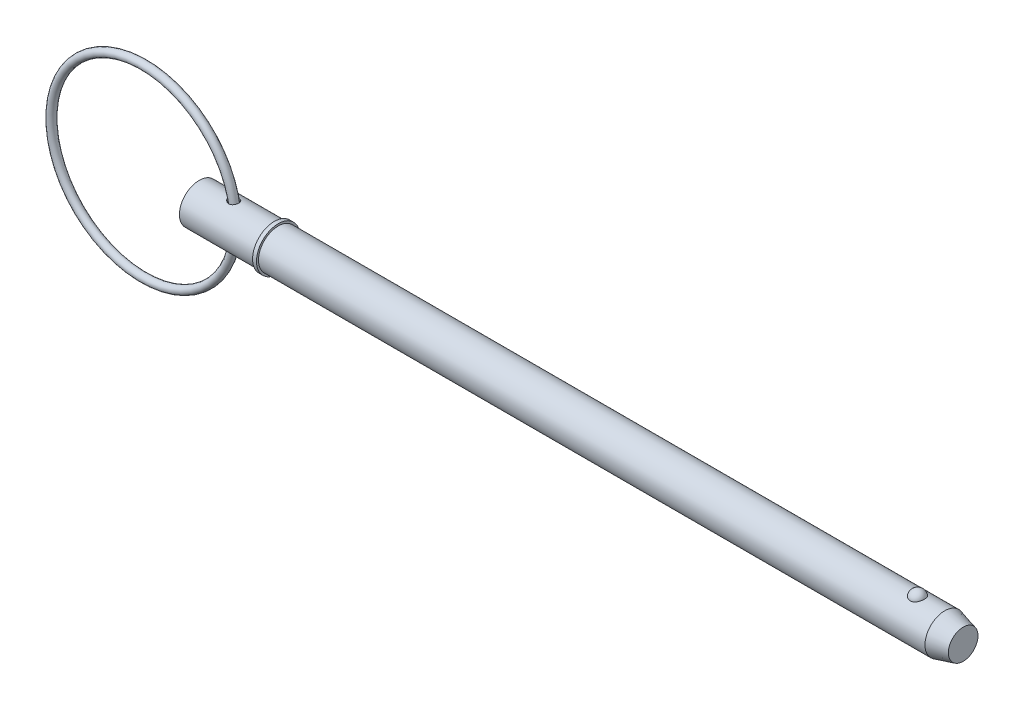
ISO-10303-21;
HEADER;
FILE_DESCRIPTION(('STEP AP214'),'2;1');
FILE_NAME('part.step','',(''),(''),'','','');
FILE_SCHEMA(('AUTOMOTIVE_DESIGN { 1 0 10303 214 1 1 1 1 }'));
ENDSEC;
DATA;
#1=APPLICATION_CONTEXT('core data for automotive mechanical design processes');
#2=APPLICATION_PROTOCOL_DEFINITION('international standard','automotive_design',2000,#1);
#3=PRODUCT_CONTEXT('',#1,'mechanical');
#4=PRODUCT('Part','Part','',(#3));
#5=PRODUCT_RELATED_PRODUCT_CATEGORY('part','',(#4));
#6=PRODUCT_DEFINITION_FORMATION('','',#4);
#7=PRODUCT_DEFINITION_CONTEXT('part definition',#1,'design');
#8=PRODUCT_DEFINITION('design','',#6,#7);
#9=PRODUCT_DEFINITION_SHAPE('','',#8);
#10=(LENGTH_UNIT() NAMED_UNIT(*) SI_UNIT(.MILLI.,.METRE.));
#11=(NAMED_UNIT(*) PLANE_ANGLE_UNIT() SI_UNIT($,.RADIAN.));
#12=(NAMED_UNIT(*) SI_UNIT($,.STERADIAN.) SOLID_ANGLE_UNIT());
#13=UNCERTAINTY_MEASURE_WITH_UNIT(LENGTH_MEASURE(1.E-05),#10,'distance_accuracy_value','');
#14=(GEOMETRIC_REPRESENTATION_CONTEXT(3) GLOBAL_UNCERTAINTY_ASSIGNED_CONTEXT((#13)) GLOBAL_UNIT_ASSIGNED_CONTEXT((#10,
#11,#12)) REPRESENTATION_CONTEXT('',''));
#15=CARTESIAN_POINT('',(0.,0.,0.));
#16=DIRECTION('',(0.,0.,1.));
#17=DIRECTION('',(1.,0.,0.));
#18=AXIS2_PLACEMENT_3D('',#15,#16,#17);
#19=CARTESIAN_POINT('',(-13.4013067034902,0.,0.));
#20=DIRECTION('',(0.,0.,1.));
#21=DIRECTION('',(1.,0.,0.));
#22=AXIS2_PLACEMENT_3D('',#19,#20,#21);
#23=TOROIDAL_SURFACE('',#22,22.225,0.952999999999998);
#24=CARTESIAN_POINT('',(9.77669329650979,0.,0.));
#25=VERTEX_POINT('',#24);
#26=VERTEX_LOOP('',#25);
#27=FACE_BOUND('',#26,.T.);
#28=ADVANCED_FACE('P0_F12',(#27),#23,.T.);
#29=CLOSED_SHELL('',(#28));
#30=MANIFOLD_SOLID_BREP('P0_B1',#29);
#31=CARTESIAN_POINT('',(0.,0.,0.));
#32=DIRECTION('',(1.,0.,0.));
#33=DIRECTION('',(0.,0.,-1.));
#34=AXIS2_PLACEMENT_3D('',#31,#32,#33);
#35=CYLINDRICAL_SURFACE('',#34,4.765);
#36=CARTESIAN_POINT('',(7.48459594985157,4.685973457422,-0.864220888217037));
#37=CARTESIAN_POINT('',(7.53849733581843,4.67711144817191,-0.912273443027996));
#38=CARTESIAN_POINT('',(7.59654891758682,4.66833039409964,-0.955745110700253));
#39=CARTESIAN_POINT('',(7.71924602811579,4.65195567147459,-1.03251233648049));
#40=CARTESIAN_POINT('',(7.78389917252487,4.64436340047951,-1.06579596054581));
#41=CARTESIAN_POINT('',(7.91808098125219,4.63129108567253,-1.12124172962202));
#42=CARTESIAN_POINT('',(7.98761280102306,4.62581242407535,-1.14339659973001));
#43=CARTESIAN_POINT('',(8.12956198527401,4.61771699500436,-1.17566870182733));
#44=CARTESIAN_POINT('',(8.20197774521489,4.61509865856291,-1.18579253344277));
#45=CARTESIAN_POINT('',(8.34550810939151,4.6131791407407,-1.19323853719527));
#46=CARTESIAN_POINT('',(8.41660306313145,4.61378793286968,-1.19090812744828));
#47=CARTESIAN_POINT('',(8.55721866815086,4.61812874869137,-1.17396277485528));
#48=CARTESIAN_POINT('',(8.62673979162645,4.62185982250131,-1.15935156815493));
#49=CARTESIAN_POINT('',(8.75801373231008,4.63172632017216,-1.11925454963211));
#50=CARTESIAN_POINT('',(8.81998342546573,4.63771186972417,-1.09443918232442));
#51=CARTESIAN_POINT('',(8.93863698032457,4.65140179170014,-1.03470792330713));
#52=CARTESIAN_POINT('',(8.99532131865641,4.65910600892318,-0.999792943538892));
#53=CARTESIAN_POINT('',(9.10080884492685,4.67519705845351,-0.921583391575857));
#54=CARTESIAN_POINT('',(9.14973848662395,4.68356861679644,-0.878455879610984));
#55=CARTESIAN_POINT('',(9.23971126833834,4.70019813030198,-0.784620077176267));
#56=CARTESIAN_POINT('',(9.28075401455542,4.7084560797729,-0.733911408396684));
#57=CARTESIAN_POINT('',(9.35441071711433,4.7240688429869,-0.62563775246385));
#58=CARTESIAN_POINT('',(9.38691359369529,4.73141115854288,-0.567995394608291));
#59=CARTESIAN_POINT('',(9.44203216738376,4.74427907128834,-0.447974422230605));
#60=CARTESIAN_POINT('',(9.46464743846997,4.74980459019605,-0.385595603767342));
#61=CARTESIAN_POINT('',(9.49961110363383,4.75848927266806,-0.257248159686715));
#62=CARTESIAN_POINT('',(9.51186382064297,4.76162635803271,-0.191251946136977));
#63=CARTESIAN_POINT('',(9.52545294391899,4.76511165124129,-0.0580729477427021));
#64=CARTESIAN_POINT('',(9.52678936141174,4.76545986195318,0.00910983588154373));
#65=CARTESIAN_POINT('',(9.51851557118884,4.76333054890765,0.142723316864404));
#66=CARTESIAN_POINT('',(9.50891008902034,4.76085424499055,0.209154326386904));
#67=CARTESIAN_POINT('',(9.47899306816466,4.75334441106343,0.339411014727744));
#68=CARTESIAN_POINT('',(9.45868126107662,4.74831081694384,0.403236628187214));
#69=CARTESIAN_POINT('',(9.4078294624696,4.73622777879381,0.526509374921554));
#70=CARTESIAN_POINT('',(9.37728413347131,4.72917728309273,0.585954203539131));
#71=CARTESIAN_POINT('',(9.30671117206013,4.71383320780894,0.698745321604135));
#72=CARTESIAN_POINT('',(9.26668347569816,4.70553961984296,0.752091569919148));
#73=CARTESIAN_POINT('',(9.17821531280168,4.68864637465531,0.851083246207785));
#74=CARTESIAN_POINT('',(9.12978756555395,4.68004719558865,0.896740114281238));
#75=CARTESIAN_POINT('',(9.02575872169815,4.66350833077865,0.97912505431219));
#76=CARTESIAN_POINT('',(8.97015856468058,4.65556855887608,1.01585429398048));
#77=CARTESIAN_POINT('',(8.85409306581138,4.6413534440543,1.0789347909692));
#78=CARTESIAN_POINT('',(8.79369898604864,4.63505812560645,1.10541268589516));
#79=CARTESIAN_POINT('',(8.66918290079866,4.62469916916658,1.1479836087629));
#80=CARTESIAN_POINT('',(8.60506121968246,4.62063533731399,1.1640775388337));
#81=CARTESIAN_POINT('',(8.47537782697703,4.61517348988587,1.18554696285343));
#82=CARTESIAN_POINT('',(8.4098281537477,4.61375835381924,1.19099130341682));
#83=CARTESIAN_POINT('',(8.2786938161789,4.61362908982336,1.19149080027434));
#84=CARTESIAN_POINT('',(8.21310914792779,4.61491539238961,1.18654430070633));
#85=CARTESIAN_POINT('',(8.08152457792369,4.62006017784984,1.16635311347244));
#86=CARTESIAN_POINT('',(8.01557748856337,4.62399895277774,1.15078675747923));
#87=CARTESIAN_POINT('',(7.88704537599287,4.63403793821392,1.10966738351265));
#88=CARTESIAN_POINT('',(7.82446148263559,4.64013886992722,1.08411103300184));
#89=CARTESIAN_POINT('',(7.70057947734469,4.65423592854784,1.02195168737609));
#90=CARTESIAN_POINT('',(7.63957197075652,4.66232221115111,0.984788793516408));
#91=CARTESIAN_POINT('',(7.52457021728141,4.67924552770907,0.900950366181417));
#92=CARTESIAN_POINT('',(7.47057819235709,4.68808279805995,0.854271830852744));
#93=CARTESIAN_POINT('',(7.37028930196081,4.70567913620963,0.751386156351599));
#94=CARTESIAN_POINT('',(7.32416327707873,4.7144333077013,0.695010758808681));
#95=CARTESIAN_POINT('',(7.24276674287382,4.73060166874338,0.574719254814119));
#96=CARTESIAN_POINT('',(7.20749051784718,4.73801656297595,0.510807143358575));
#97=CARTESIAN_POINT('',(7.15148495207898,4.75009927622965,0.381705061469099));
#98=CARTESIAN_POINT('',(7.12994463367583,4.7549169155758,0.31688231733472));
#99=CARTESIAN_POINT('',(7.09904467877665,4.76189692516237,0.184270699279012));
#100=CARTESIAN_POINT('',(7.08967554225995,4.76406136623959,0.116484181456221));
#101=CARTESIAN_POINT('',(7.08394150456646,4.76538257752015,-0.0133529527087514));
#102=CARTESIAN_POINT('',(7.0864533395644,4.76479916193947,-0.0753538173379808));
#103=CARTESIAN_POINT('',(7.10181380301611,4.76127985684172,-0.197993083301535));
#104=CARTESIAN_POINT('',(7.11466291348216,4.75834385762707,-0.258631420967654));
#105=CARTESIAN_POINT('',(7.14973937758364,4.75051877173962,-0.375744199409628));
#106=CARTESIAN_POINT('',(7.17178938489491,4.7456667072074,-0.432274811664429));
#107=CARTESIAN_POINT('',(7.22432962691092,4.73449674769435,-0.54107038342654));
#108=CARTESIAN_POINT('',(7.25481702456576,4.72817934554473,-0.593336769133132));
#109=CARTESIAN_POINT('',(7.31700895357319,4.71588241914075,-0.683642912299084));
#110=CARTESIAN_POINT('',(7.34750058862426,4.7100477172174,-0.722547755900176));
#111=CARTESIAN_POINT('',(7.41288050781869,4.69812059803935,-0.796421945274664));
#112=CARTESIAN_POINT('',(7.44776960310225,4.69202813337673,-0.831390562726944));
#113=CARTESIAN_POINT('',(7.48459594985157,4.685973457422,-0.864220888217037));
#114=B_SPLINE_CURVE_WITH_KNOTS('',3,(#36,#37,#38,#39,#40,#41,#42,#43,#44,#45,#46,#47,#48,#49,
#50,#51,#52,#53,#54,#55,#56,#57,#58,#59,#60,#61,#62,#63,#64,#65,#66,#67,#68,#69,#70,#71,#72,#73,
#74,#75,#76,#77,#78,#79,#80,#81,#82,#83,#84,#85,#86,#87,#88,#89,#90,#91,#92,#93,#94,#95,#96,#97,
#98,#99,#100,#101,#102,#103,#104,#105,#106,#107,#108,#109,#110,#111,#112,#113),.UNSPECIFIED.,
.T.,.F.,(4,2,2,2,2,2,2,2,2,2,2,2,2,2,2,2,2,2,2,2,2,2,2,2,2,2,2,2,2,2,2,2,2,2,2,2,2,2,4),(0.,
0.218078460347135,0.436411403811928,0.654886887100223,0.873242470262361,1.08553925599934,
1.2977714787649,1.49785367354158,1.6979178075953,1.8942789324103,2.09064985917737,
2.28946102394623,2.48828075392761,2.68891673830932,2.88955251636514,3.09010167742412,
3.29065586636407,3.49131482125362,3.69197512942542,3.89233421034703,4.09266707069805,
4.29043955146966,4.48819484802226,4.68466743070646,4.8811713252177,5.08390806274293,
5.28671248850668,5.50140943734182,5.71617422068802,5.93513249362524,6.15397522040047,
6.35827356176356,6.56241234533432,6.74765856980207,6.93291343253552,7.11475139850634,
7.29652829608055,7.44549570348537,7.59449062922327),.UNSPECIFIED.);
#115=CARTESIAN_POINT('',(7.48459594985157,4.685973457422,-0.864220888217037));
#116=VERTEX_POINT('',#115);
#117=EDGE_CURVE('P1_E42',#116,#116,#114,.T.);
#118=ORIENTED_EDGE('',*,*,#117,.T.);
#119=EDGE_LOOP('',(#118));
#120=FACE_BOUND('',#119,.T.);
#121=CARTESIAN_POINT('',(0.,0.,0.));
#122=DIRECTION('',(1.,0.,0.));
#123=DIRECTION('',(0.,0.,-1.));
#124=AXIS2_PLACEMENT_3D('',#121,#122,#123);
#125=CIRCLE('',#124,4.765);
#126=CARTESIAN_POINT('',(0.,0.,-4.765));
#127=VERTEX_POINT('',#126);
#128=EDGE_CURVE('P1_E9',#127,#127,#125,.T.);
#129=ORIENTED_EDGE('',*,*,#128,.T.);
#130=EDGE_LOOP('',(#129));
#131=FACE_BOUND('',#130,.T.);
#132=CARTESIAN_POINT('',(18.097,0.,0.));
#133=DIRECTION('',(1.,0.,0.));
#134=DIRECTION('',(0.,0.,-1.));
#135=AXIS2_PLACEMENT_3D('',#132,#133,#134);
#136=CIRCLE('',#135,4.765);
#137=CARTESIAN_POINT('',(18.097,0.,-4.765));
#138=VERTEX_POINT('',#137);
#139=EDGE_CURVE('P1_E25',#138,#138,#136,.T.);
#140=ORIENTED_EDGE('',*,*,#139,.F.);
#141=EDGE_LOOP('',(#140));
#142=FACE_BOUND('',#141,.T.);
#143=CARTESIAN_POINT('',(7.48459594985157,-4.685973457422,-0.864220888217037));
#144=CARTESIAN_POINT('',(7.43440944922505,-4.6942250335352,-0.819477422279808));
#145=CARTESIAN_POINT('',(7.38778663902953,-4.70255210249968,-0.77073361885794));
#146=CARTESIAN_POINT('',(7.3030968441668,-4.7184989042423,-0.666172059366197));
#147=CARTESIAN_POINT('',(7.26503010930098,-4.72611861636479,-0.610354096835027));
#148=CARTESIAN_POINT('',(7.19878266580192,-4.73983819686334,-0.492624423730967));
#149=CARTESIAN_POINT('',(7.17064194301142,-4.74593188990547,-0.430689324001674));
#150=CARTESIAN_POINT('',(7.12584349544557,-4.75581281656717,-0.3026233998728));
#151=CARTESIAN_POINT('',(7.10917889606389,-4.75960143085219,-0.236495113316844));
#152=CARTESIAN_POINT('',(7.0889853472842,-4.76421379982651,-0.106818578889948));
#153=CARTESIAN_POINT('',(7.0846333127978,-4.76522320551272,-0.0434047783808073));
#154=CARTESIAN_POINT('',(7.08693064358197,-4.7646936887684,0.0832041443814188));
#155=CARTESIAN_POINT('',(7.09357756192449,-4.76315533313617,0.146399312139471));
#156=CARTESIAN_POINT('',(7.11694629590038,-4.75784365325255,0.267709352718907));
#157=CARTESIAN_POINT('',(7.13318365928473,-4.75417793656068,0.325923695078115));
#158=CARTESIAN_POINT('',(7.17459606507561,-4.74508048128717,0.438922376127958));
#159=CARTESIAN_POINT('',(7.19977257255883,-4.73964845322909,0.493706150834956));
#160=CARTESIAN_POINT('',(7.25946789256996,-4.72725615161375,0.60111049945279));
#161=CARTESIAN_POINT('',(7.2943661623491,-4.72023663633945,0.653512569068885));
#162=CARTESIAN_POINT('',(7.37173226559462,-4.70550732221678,0.752279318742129));
#163=CARTESIAN_POINT('',(7.41420315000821,-4.69779724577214,0.798641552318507));
#164=CARTESIAN_POINT('',(7.50982312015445,-4.6816641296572,0.888551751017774));
#165=CARTESIAN_POINT('',(7.56359853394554,-4.67324162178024,0.931434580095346));
#166=CARTESIAN_POINT('',(7.67736628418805,-4.65728554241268,1.00819498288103));
#167=CARTESIAN_POINT('',(7.7373611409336,-4.64975233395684,1.04206888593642));
#168=CARTESIAN_POINT('',(7.86574076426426,-4.63599923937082,1.10169445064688));
#169=CARTESIAN_POINT('',(7.93441048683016,-4.62988111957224,1.12685968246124));
#170=CARTESIAN_POINT('',(8.07519000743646,-4.62035710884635,1.16529928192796));
#171=CARTESIAN_POINT('',(8.14729925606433,-4.61695078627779,1.1785755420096));
#172=CARTESIAN_POINT('',(8.29111621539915,-4.61341807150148,1.19232949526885));
#173=CARTESIAN_POINT('',(8.36279361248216,-4.61321655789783,1.19310032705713));
#174=CARTESIAN_POINT('',(8.50512944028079,-4.61602317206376,1.1821962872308));
#175=CARTESIAN_POINT('',(8.57578827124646,-4.61903000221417,1.17052644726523));
#176=CARTESIAN_POINT('',(8.70965757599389,-4.62766311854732,1.13589249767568));
#177=CARTESIAN_POINT('',(8.77306169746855,-4.63312492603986,1.11363308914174));
#178=CARTESIAN_POINT('',(8.8949702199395,-4.64598463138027,1.05869880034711));
#179=CARTESIAN_POINT('',(8.95347516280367,-4.65338231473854,1.02602507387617));
#180=CARTESIAN_POINT('',(9.06253415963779,-4.66906009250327,0.952097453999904));
#181=CARTESIAN_POINT('',(9.11324728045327,-4.67731427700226,0.911072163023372));
#182=CARTESIAN_POINT('',(9.20707850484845,-4.69393979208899,0.821122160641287));
#183=CARTESIAN_POINT('',(9.25019629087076,-4.70231112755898,0.772197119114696));
#184=CARTESIAN_POINT('',(9.32819072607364,-4.71835356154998,0.667239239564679));
#185=CARTESIAN_POINT('',(9.36297449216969,-4.72601623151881,0.611136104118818));
#186=CARTESIAN_POINT('',(9.42286382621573,-4.73971239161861,0.493799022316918));
#187=CARTESIAN_POINT('',(9.44796891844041,-4.74574580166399,0.432564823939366));
#188=CARTESIAN_POINT('',(9.48811605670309,-4.75559286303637,0.305990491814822));
#189=CARTESIAN_POINT('',(9.50304870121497,-4.75938232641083,0.240613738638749));
#190=CARTESIAN_POINT('',(9.5220569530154,-4.76423188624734,0.108201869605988));
#191=CARTESIAN_POINT('',(9.52613255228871,-4.76529198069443,0.0411667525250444));
#192=CARTESIAN_POINT('',(9.52332772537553,-4.76456884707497,-0.0926701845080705));
#193=CARTESIAN_POINT('',(9.51644541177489,-4.76278512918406,-0.159471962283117));
#194=CARTESIAN_POINT('',(9.49188827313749,-4.75656536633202,-0.290934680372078));
#195=CARTESIAN_POINT('',(9.47421322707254,-4.75212926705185,-0.355595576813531));
#196=CARTESIAN_POINT('',(9.42849503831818,-4.74108318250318,-0.480955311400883));
#197=CARTESIAN_POINT('',(9.4004503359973,-4.73447287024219,-0.541653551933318));
#198=CARTESIAN_POINT('',(9.33467290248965,-4.71979928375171,-0.657361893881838));
#199=CARTESIAN_POINT('',(9.29694000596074,-4.71173598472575,-0.712371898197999));
#200=CARTESIAN_POINT('',(9.2127449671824,-4.69505469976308,-0.815106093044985));
#201=CARTESIAN_POINT('',(9.1662875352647,-4.68643701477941,-0.862834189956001));
#202=CARTESIAN_POINT('',(9.06584125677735,-4.66961864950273,-0.949656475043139));
#203=CARTESIAN_POINT('',(9.01185326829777,-4.66141792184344,-0.98875164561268));
#204=CARTESIAN_POINT('',(8.8985010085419,-4.64646376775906,-1.0567894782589));
#205=CARTESIAN_POINT('',(8.83920621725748,-4.63969468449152,-1.08584444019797));
#206=CARTESIAN_POINT('',(8.71642097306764,-4.62824519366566,-1.13365785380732));
#207=CARTESIAN_POINT('',(8.65293102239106,-4.623564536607,-1.15241753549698));
#208=CARTESIAN_POINT('',(8.52421291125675,-4.61681938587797,-1.17914952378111));
#209=CARTESIAN_POINT('',(8.45900634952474,-4.6147310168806,-1.18722032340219));
#210=CARTESIAN_POINT('',(8.32811210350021,-4.61325848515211,-1.19292878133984));
#211=CARTESIAN_POINT('',(8.26242433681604,-4.61387479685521,-1.19056460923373));
#212=CARTESIAN_POINT('',(8.13057358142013,-4.6177227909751,-1.17555160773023));
#213=CARTESIAN_POINT('',(8.06444352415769,-4.62102282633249,-1.16263394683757));
#214=CARTESIAN_POINT('',(7.93513143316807,-4.62989870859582,-1.12676570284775));
#215=CARTESIAN_POINT('',(7.87194976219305,-4.6354748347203,-1.10381388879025));
#216=CARTESIAN_POINT('',(7.75155849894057,-4.64811746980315,-1.04928030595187));
#217=CARTESIAN_POINT('',(7.69423767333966,-4.65514232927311,-1.01793362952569));
#218=CARTESIAN_POINT('',(7.58503138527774,-4.67007903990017,-0.947046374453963));
#219=CARTESIAN_POINT('',(7.53314612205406,-4.67799092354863,-0.907505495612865));
#220=CARTESIAN_POINT('',(7.48459594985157,-4.685973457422,-0.864220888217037));
#221=B_SPLINE_CURVE_WITH_KNOTS('',3,(#143,#144,#145,#146,#147,#148,#149,#150,#151,#152,#153,
#154,#155,#156,#157,#158,#159,#160,#161,#162,#163,#164,#165,#166,#167,#168,#169,#170,#171,#172,
#173,#174,#175,#176,#177,#178,#179,#180,#181,#182,#183,#184,#185,#186,#187,#188,#189,#190,#191,
#192,#193,#194,#195,#196,#197,#198,#199,#200,#201,#202,#203,#204,#205,#206,#207,#208,#209,#210,
#211,#212,#213,#214,#215,#216,#217,#218,#219,#220),.UNSPECIFIED.,.T.,.F.,(4,2,2,2,2,2,2,2,2,2,2,
2,2,2,2,2,2,2,2,2,2,2,2,2,2,2,2,2,2,2,2,2,2,2,2,2,2,2,4),(0.,0.203013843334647,
0.406033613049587,0.609862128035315,0.813568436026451,1.0032929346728,1.19297523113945,
1.37380897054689,1.55467236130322,1.74393241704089,1.93326889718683,2.14025373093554,
2.3473227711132,2.566425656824,2.78549366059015,2.9994188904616,3.21325763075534,
3.41451842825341,3.61575693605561,3.81208930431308,4.00842987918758,4.20686629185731,
4.40531245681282,4.60586051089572,4.80640871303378,5.0069914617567,5.20757831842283,
5.40819535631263,5.60881581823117,5.80932827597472,6.00981790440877,6.2079863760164,
6.40613116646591,6.60243714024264,6.79877754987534,7.00028133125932,7.20180983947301,
7.39819723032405,7.59459181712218),.UNSPECIFIED.);
#222=CARTESIAN_POINT('',(7.48459594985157,-4.685973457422,-0.864220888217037));
#223=VERTEX_POINT('',#222);
#224=EDGE_CURVE('P1_E17',#223,#223,#221,.T.);
#225=ORIENTED_EDGE('',*,*,#224,.T.);
#226=EDGE_LOOP('',(#225));
#227=FACE_BOUND('',#226,.T.);
#228=ADVANCED_FACE('P1_F13',(#120,#131,#142,#227),#35,.T.);
#229=CARTESIAN_POINT('',(0.,0.,0.));
#230=DIRECTION('',(1.,0.,0.));
#231=DIRECTION('',(0.,0.,-1.));
#232=AXIS2_PLACEMENT_3D('',#229,#230,#231);
#233=CYLINDRICAL_SURFACE('',#232,4.765);
#234=CARTESIAN_POINT('',(179.704194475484,0.,0.));
#235=DIRECTION('',(1.,0.,0.));
#236=DIRECTION('',(0.,0.,-1.));
#237=AXIS2_PLACEMENT_3D('',#234,#235,#236);
#238=CIRCLE('',#237,4.765);
#239=CARTESIAN_POINT('',(179.704194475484,0.,-4.765));
#240=VERTEX_POINT('',#239);
#241=EDGE_CURVE('P1_E99',#240,#240,#238,.T.);
#242=ORIENTED_EDGE('',*,*,#241,.F.);
#243=EDGE_LOOP('',(#242));
#244=FACE_BOUND('',#243,.T.);
#245=CARTESIAN_POINT('',(19.05,0.,0.));
#246=DIRECTION('',(1.,0.,0.));
#247=DIRECTION('',(0.,0.,-1.));
#248=AXIS2_PLACEMENT_3D('',#245,#246,#247);
#249=CIRCLE('',#248,4.765);
#250=CARTESIAN_POINT('',(19.05,0.,-4.765));
#251=VERTEX_POINT('',#250);
#252=EDGE_CURVE('P1_E96',#251,#251,#249,.T.);
#253=ORIENTED_EDGE('',*,*,#252,.T.);
#254=EDGE_LOOP('',(#253));
#255=FACE_BOUND('',#254,.T.);
#256=CARTESIAN_POINT('',(173.151020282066,4.42764777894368,1.76101111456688));
#257=CARTESIAN_POINT('',(173.059721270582,4.42764470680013,1.76101422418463));
#258=CARTESIAN_POINT('',(172.968446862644,4.43059091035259,1.75366340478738));
#259=CARTESIAN_POINT('',(172.788615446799,4.44201846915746,1.72451180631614));
#260=CARTESIAN_POINT('',(172.700057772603,4.45049845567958,1.70271460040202));
#261=CARTESIAN_POINT('',(172.528257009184,4.47200516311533,1.64539370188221));
#262=CARTESIAN_POINT('',(172.445006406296,4.48502527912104,1.60988994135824));
#263=CARTESIAN_POINT('',(172.285763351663,4.51419542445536,1.52617873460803));
#264=CARTESIAN_POINT('',(172.209772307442,4.53034605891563,1.47796883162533));
#265=CARTESIAN_POINT('',(172.064744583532,4.56459317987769,1.36860494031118));
#266=CARTESIAN_POINT('',(171.995964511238,4.58273170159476,1.30712420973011));
#267=CARTESIAN_POINT('',(171.869342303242,4.61870302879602,1.17370204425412));
#268=CARTESIAN_POINT('',(171.811502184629,4.63653577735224,1.10175868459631));
#269=CARTESIAN_POINT('',(171.705570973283,4.67090140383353,0.945806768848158));
#270=CARTESIAN_POINT('',(171.658030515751,4.68734068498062,0.861402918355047));
#271=CARTESIAN_POINT('',(171.577081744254,4.71628466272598,0.685442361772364));
#272=CARTESIAN_POINT('',(171.543674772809,4.72878898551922,0.593884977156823));
#273=CARTESIAN_POINT('',(171.491287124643,4.74874061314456,0.404781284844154));
#274=CARTESIAN_POINT('',(171.472517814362,4.75611366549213,0.307168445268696));
#275=CARTESIAN_POINT('',(171.450584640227,4.76475393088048,0.109940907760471));
#276=CARTESIAN_POINT('',(171.447420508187,4.76602124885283,0.0103262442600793));
#277=CARTESIAN_POINT('',(171.456740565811,4.76232928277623,-0.187629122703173));
#278=CARTESIAN_POINT('',(171.469158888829,4.7573962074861,-0.285973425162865));
#279=CARTESIAN_POINT('',(171.509280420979,4.74184975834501,-0.47902728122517));
#280=CARTESIAN_POINT('',(171.536983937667,4.7312362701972,-0.573736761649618));
#281=CARTESIAN_POINT('',(171.607158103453,4.70540026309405,-0.75697393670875));
#282=CARTESIAN_POINT('',(171.649646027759,4.69017235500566,-0.845494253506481));
#283=CARTESIAN_POINT('',(171.748520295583,4.6566986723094,-1.01378033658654));
#284=CARTESIAN_POINT('',(171.804907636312,4.63845268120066,-1.09354547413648));
#285=CARTESIAN_POINT('',(171.930552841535,4.60085438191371,-1.24228523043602));
#286=CARTESIAN_POINT('',(171.999843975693,4.58149930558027,-1.31123108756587));
#287=CARTESIAN_POINT('',(172.149606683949,4.54391653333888,-1.43607409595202));
#288=CARTESIAN_POINT('',(172.230077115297,4.52568872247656,-1.49197257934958));
#289=CARTESIAN_POINT('',(172.398150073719,4.49293007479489,-1.58786764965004));
#290=CARTESIAN_POINT('',(172.485544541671,4.47832346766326,-1.62820219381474));
#291=CARTESIAN_POINT('',(172.666553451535,4.45406011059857,-1.69345757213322));
#292=CARTESIAN_POINT('',(172.76016555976,4.44440151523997,-1.71838415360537));
#293=CARTESIAN_POINT('',(172.945893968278,4.43159888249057,-1.75112843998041));
#294=CARTESIAN_POINT('',(173.037849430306,4.42815213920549,-1.75974223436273));
#295=CARTESIAN_POINT('',(173.221965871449,4.427247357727,-1.76201865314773));
#296=CARTESIAN_POINT('',(173.314126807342,4.42978816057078,-1.7556841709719));
#297=CARTESIAN_POINT('',(173.493129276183,4.44038648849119,-1.72869560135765));
#298=CARTESIAN_POINT('',(173.580047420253,4.44827555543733,-1.70847853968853));
#299=CARTESIAN_POINT('',(173.749131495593,4.46852246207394,-1.65479562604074));
#300=CARTESIAN_POINT('',(173.831297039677,4.48088066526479,-1.62132869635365));
#301=CARTESIAN_POINT('',(173.990591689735,4.50907357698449,-1.54120560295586));
#302=CARTESIAN_POINT('',(174.067570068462,4.52497884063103,-1.49427526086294));
#303=CARTESIAN_POINT('',(174.212708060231,4.55845148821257,-1.38881222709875));
#304=CARTESIAN_POINT('',(174.280865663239,4.57601924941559,-1.33027689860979));
#305=CARTESIAN_POINT('',(174.410099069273,4.61196537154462,-1.19991049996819));
#306=CARTESIAN_POINT('',(174.470656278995,4.63034074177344,-1.12756415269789));
#307=CARTESIAN_POINT('',(174.579279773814,4.66513959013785,-0.973612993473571));
#308=CARTESIAN_POINT('',(174.627343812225,4.68156271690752,-0.89200652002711));
#309=CARTESIAN_POINT('',(174.711383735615,4.71130224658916,-0.718892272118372));
#310=CARTESIAN_POINT('',(174.746918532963,4.724501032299,-0.627149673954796));
#311=CARTESIAN_POINT('',(174.802952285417,4.74571823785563,-0.43861154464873));
#312=CARTESIAN_POINT('',(174.823450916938,4.75373654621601,-0.341815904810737));
#313=CARTESIAN_POINT('',(174.849033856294,4.76378905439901,-0.145633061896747));
#314=CARTESIAN_POINT('',(174.854076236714,4.76580697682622,-0.0462395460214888));
#315=CARTESIAN_POINT('',(174.848523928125,4.7636057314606,0.152038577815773));
#316=CARTESIAN_POINT('',(174.837929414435,4.75938663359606,0.250923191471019));
#317=CARTESIAN_POINT('',(174.801387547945,4.74516937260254,0.445004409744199));
#318=CARTESIAN_POINT('',(174.775496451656,4.73519238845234,0.540213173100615));
#319=CARTESIAN_POINT('',(174.708927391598,4.71049394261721,0.724662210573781));
#320=CARTESIAN_POINT('',(174.668248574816,4.69577220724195,0.813902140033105));
#321=CARTESIAN_POINT('',(174.572717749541,4.66303767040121,0.984313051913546));
#322=CARTESIAN_POINT('',(174.517804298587,4.64501070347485,1.06544688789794));
#323=CARTESIAN_POINT('',(174.395049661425,4.60764678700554,1.21692673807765));
#324=CARTESIAN_POINT('',(174.327208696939,4.58830985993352,1.28727293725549));
#325=CARTESIAN_POINT('',(174.180548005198,4.55060370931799,1.41479271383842));
#326=CARTESIAN_POINT('',(174.101791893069,4.53222967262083,1.4720378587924));
#327=CARTESIAN_POINT('',(173.934989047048,4.49849576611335,1.57212016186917));
#328=CARTESIAN_POINT('',(173.846941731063,4.48313608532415,1.6149564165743));
#329=CARTESIAN_POINT('',(173.659791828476,4.45676184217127,1.68642657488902));
#330=CARTESIAN_POINT('',(173.560365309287,4.44598302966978,1.71430590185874));
#331=CARTESIAN_POINT('',(173.357621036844,4.43142918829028,1.7515925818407));
#332=CARTESIAN_POINT('',(173.254304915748,4.42765125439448,1.76100759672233));
#333=CARTESIAN_POINT('',(173.151020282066,4.42764777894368,1.76101111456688));
#334=B_SPLINE_CURVE_WITH_KNOTS('',3,(#256,#257,#258,#259,#260,#261,#262,#263,#264,#265,#266,
#267,#268,#269,#270,#271,#272,#273,#274,#275,#276,#277,#278,#279,#280,#281,#282,#283,#284,#285,
#286,#287,#288,#289,#290,#291,#292,#293,#294,#295,#296,#297,#298,#299,#300,#301,#302,#303,#304,
#305,#306,#307,#308,#309,#310,#311,#312,#313,#314,#315,#316,#317,#318,#319,#320,#321,#322,#323,
#324,#325,#326,#327,#328,#329,#330,#331,#332,#333),.UNSPECIFIED.,.T.,.F.,(4,2,2,2,2,2,2,2,2,2,2,
2,2,2,2,2,2,2,2,2,2,2,2,2,2,2,2,2,2,2,2,2,2,2,2,2,2,2,4),(0.,0.273517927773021,
0.546968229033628,0.820022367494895,1.09312934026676,1.37393946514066,1.6548013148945,
1.94820420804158,2.24163496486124,2.53922817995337,2.83681628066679,3.13315071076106,
3.42949110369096,3.72617893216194,4.02288805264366,4.32037303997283,4.61782764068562,
4.90840095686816,5.19886582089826,5.47474855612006,5.75057789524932,6.0180997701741,
6.28564340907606,6.55907787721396,6.83257454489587,7.11962987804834,7.4067367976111,
7.70312663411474,7.99952284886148,8.29672237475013,8.59391856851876,8.89002850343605,
9.18615552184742,9.48358266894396,9.7810047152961,10.0767610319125,10.3725358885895,
10.6820893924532,10.991514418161),.UNSPECIFIED.);
#335=CARTESIAN_POINT('',(173.151020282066,4.42764777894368,1.76101111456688));
#336=VERTEX_POINT('',#335);
#337=EDGE_CURVE('P1_E34',#336,#336,#334,.T.);
#338=ORIENTED_EDGE('',*,*,#337,.T.);
#339=EDGE_LOOP('',(#338));
#340=FACE_BOUND('',#339,.T.);
#341=ADVANCED_FACE('P1_F46',(#244,#255,#340),#233,.T.);
#342=CARTESIAN_POINT('',(0.,0.,0.));
#343=DIRECTION('',(-1.,0.,0.));
#344=DIRECTION('',(0.,0.,1.));
#345=AXIS2_PLACEMENT_3D('',#342,#343,#344);
#346=PLANE('',#345);
#347=ORIENTED_EDGE('',*,*,#128,.F.);
#348=EDGE_LOOP('',(#347));
#349=FACE_BOUND('',#348,.T.);
#350=ADVANCED_FACE('P1_F15',(#349),#346,.T.);
#351=CARTESIAN_POINT('',(18.097,4.765,0.));
#352=DIRECTION('',(-1.,0.,0.));
#353=DIRECTION('',(0.,0.,1.));
#354=AXIS2_PLACEMENT_3D('',#351,#352,#353);
#355=PLANE('',#354);
#356=ORIENTED_EDGE('',*,*,#139,.T.);
#357=EDGE_LOOP('',(#356));
#358=FACE_BOUND('',#357,.T.);
#359=CARTESIAN_POINT('',(18.097,0.,0.));
#360=DIRECTION('',(1.,0.,0.));
#361=DIRECTION('',(0.,0.,-1.));
#362=AXIS2_PLACEMENT_3D('',#359,#360,#361);
#363=CIRCLE('',#362,5.2415);
#364=CARTESIAN_POINT('',(18.097,0.,-5.2415));
#365=VERTEX_POINT('',#364);
#366=EDGE_CURVE('P1_E30',#365,#365,#363,.T.);
#367=ORIENTED_EDGE('',*,*,#366,.F.);
#368=EDGE_LOOP('',(#367));
#369=FACE_BOUND('',#368,.T.);
#370=ADVANCED_FACE('P1_F81',(#358,#369),#355,.T.);
#371=CARTESIAN_POINT('',(0.,0.,0.));
#372=DIRECTION('',(1.,0.,0.));
#373=DIRECTION('',(0.,0.,-1.));
#374=AXIS2_PLACEMENT_3D('',#371,#372,#373);
#375=CYLINDRICAL_SURFACE('',#374,5.2415);
#376=ORIENTED_EDGE('',*,*,#366,.T.);
#377=EDGE_LOOP('',(#376));
#378=FACE_BOUND('',#377,.T.);
#379=CARTESIAN_POINT('',(19.05,0.,0.));
#380=DIRECTION('',(1.,0.,0.));
#381=DIRECTION('',(0.,0.,-1.));
#382=AXIS2_PLACEMENT_3D('',#379,#380,#381);
#383=CIRCLE('',#382,5.2415);
#384=CARTESIAN_POINT('',(19.05,0.,-5.2415));
#385=VERTEX_POINT('',#384);
#386=EDGE_CURVE('P1_E95',#385,#385,#383,.T.);
#387=ORIENTED_EDGE('',*,*,#386,.F.);
#388=EDGE_LOOP('',(#387));
#389=FACE_BOUND('',#388,.T.);
#390=ADVANCED_FACE('P1_F68',(#378,#389),#375,.T.);
#391=CARTESIAN_POINT('',(19.05,5.2415,0.));
#392=DIRECTION('',(1.,0.,0.));
#393=DIRECTION('',(0.,0.,-1.));
#394=AXIS2_PLACEMENT_3D('',#391,#392,#393);
#395=PLANE('',#394);
#396=ORIENTED_EDGE('',*,*,#386,.T.);
#397=EDGE_LOOP('',(#396));
#398=FACE_BOUND('',#397,.T.);
#399=ORIENTED_EDGE('',*,*,#252,.F.);
#400=EDGE_LOOP('',(#399));
#401=FACE_BOUND('',#400,.T.);
#402=ADVANCED_FACE('P1_F62',(#398,#401),#395,.T.);
#403=CARTESIAN_POINT('',(184.15,0.,0.));
#404=DIRECTION('',(-1.,0.,0.));
#405=DIRECTION('',(0.,0.,1.));
#406=AXIS2_PLACEMENT_3D('',#403,#404,#405);
#407=CONICAL_SURFACE('',#406,3.57375000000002,0.261799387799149);
#408=ORIENTED_EDGE('',*,*,#241,.T.);
#409=EDGE_LOOP('',(#408));
#410=FACE_BOUND('',#409,.T.);
#411=CARTESIAN_POINT('',(184.15,0.,0.));
#412=DIRECTION('',(1.,0.,0.));
#413=DIRECTION('',(0.,0.,-1.));
#414=AXIS2_PLACEMENT_3D('',#411,#412,#413);
#415=CIRCLE('',#414,3.57375000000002);
#416=CARTESIAN_POINT('',(184.15,0.,-3.57375000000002));
#417=VERTEX_POINT('',#416);
#418=EDGE_CURVE('P1_E41',#417,#417,#415,.T.);
#419=ORIENTED_EDGE('',*,*,#418,.F.);
#420=EDGE_LOOP('',(#419));
#421=FACE_BOUND('',#420,.T.);
#422=ADVANCED_FACE('P1_F59',(#410,#421),#407,.T.);
#423=CARTESIAN_POINT('',(184.15,3.57375000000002,0.));
#424=DIRECTION('',(1.,0.,0.));
#425=DIRECTION('',(0.,0.,-1.));
#426=AXIS2_PLACEMENT_3D('',#423,#424,#425);
#427=PLANE('',#426);
#428=ORIENTED_EDGE('',*,*,#418,.T.);
#429=EDGE_LOOP('',(#428));
#430=FACE_BOUND('',#429,.T.);
#431=ADVANCED_FACE('P1_F55',(#430),#427,.T.);
#432=CARTESIAN_POINT('',(173.151020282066,4.28849999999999,0.));
#433=DIRECTION('',(-1.,0.,0.));
#434=DIRECTION('',(0.,-1.,0.));
#435=AXIS2_PLACEMENT_3D('',#432,#433,#434);
#436=SPHERICAL_SURFACE('',#435,1.7665);
#437=ORIENTED_EDGE('',*,*,#337,.F.);
#438=EDGE_LOOP('',(#437));
#439=FACE_BOUND('',#438,.T.);
#440=ADVANCED_FACE('P1_F50',(#439),#436,.T.);
#441=CARTESIAN_POINT('',(-13.4013067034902,0.,0.));
#442=DIRECTION('',(0.,0.,1.));
#443=DIRECTION('',(1.,0.,0.));
#444=AXIS2_PLACEMENT_3D('',#441,#442,#443);
#445=TOROIDAL_SURFACE('',#444,22.225,1.19125);
#446=ORIENTED_EDGE('',*,*,#224,.F.);
#447=EDGE_LOOP('',(#446));
#448=FACE_BOUND('',#447,.T.);
#449=ORIENTED_EDGE('',*,*,#117,.F.);
#450=EDGE_LOOP('',(#449));
#451=FACE_BOUND('',#450,.T.);
#452=ADVANCED_FACE('P1_F54',(#448,#451),#445,.F.);
#453=CLOSED_SHELL('',(#228,#341,#350,#370,#390,#402,#422,#431,#440,#452));
#454=MANIFOLD_SOLID_BREP('P1_B1',#453);
#455=ADVANCED_BREP_SHAPE_REPRESENTATION('',(#18,#30,#454),#14);
#456=SHAPE_DEFINITION_REPRESENTATION(#9,#455);
ENDSEC;
END-ISO-10303-21;
